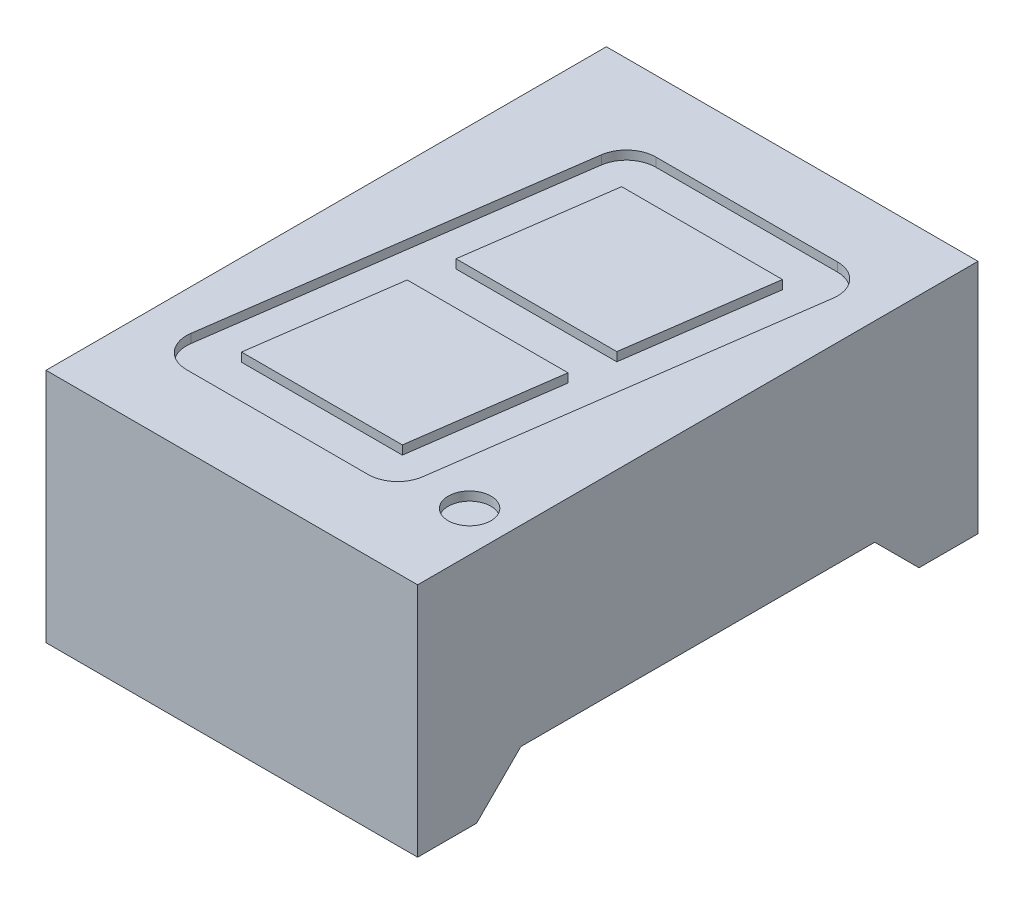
ISO-10303-21;
HEADER;
FILE_DESCRIPTION(('STEP AP214'),'2;1');
FILE_NAME('part.step','',(''),(''),'','','');
FILE_SCHEMA(('AUTOMOTIVE_DESIGN { 1 0 10303 214 1 1 1 1 }'));
ENDSEC;
DATA;
#1=APPLICATION_CONTEXT('core data for automotive mechanical design processes');
#2=APPLICATION_PROTOCOL_DEFINITION('international standard','automotive_design',2000,#1);
#3=PRODUCT_CONTEXT('',#1,'mechanical');
#4=PRODUCT('Part','Part','',(#3));
#5=PRODUCT_RELATED_PRODUCT_CATEGORY('part','',(#4));
#6=PRODUCT_DEFINITION_FORMATION('','',#4);
#7=PRODUCT_DEFINITION_CONTEXT('part definition',#1,'design');
#8=PRODUCT_DEFINITION('design','',#6,#7);
#9=PRODUCT_DEFINITION_SHAPE('','',#8);
#10=(LENGTH_UNIT() NAMED_UNIT(*) SI_UNIT(.MILLI.,.METRE.));
#11=(NAMED_UNIT(*) PLANE_ANGLE_UNIT() SI_UNIT($,.RADIAN.));
#12=(NAMED_UNIT(*) SI_UNIT($,.STERADIAN.) SOLID_ANGLE_UNIT());
#13=UNCERTAINTY_MEASURE_WITH_UNIT(LENGTH_MEASURE(1.E-05),#10,'distance_accuracy_value','');
#14=(GEOMETRIC_REPRESENTATION_CONTEXT(3) GLOBAL_UNCERTAINTY_ASSIGNED_CONTEXT((#13)) GLOBAL_UNIT_ASSIGNED_CONTEXT((#10,
#11,#12)) REPRESENTATION_CONTEXT('',''));
#15=CARTESIAN_POINT('',(0.,0.,0.));
#16=DIRECTION('',(0.,0.,1.));
#17=DIRECTION('',(1.,0.,0.));
#18=AXIS2_PLACEMENT_3D('',#15,#16,#17);
#19=CARTESIAN_POINT('',(0.,0.,0.));
#20=DIRECTION('',(0.,1.,0.));
#21=DIRECTION('',(0.,0.,1.));
#22=AXIS2_PLACEMENT_3D('',#19,#20,#21);
#23=PLANE('',#22);
#24=DIRECTION('',(0.,0.,-1.));
#25=VECTOR('',#24,1.);
#26=CARTESIAN_POINT('',(12.6,0.,0.));
#27=LINE('',#26,#25);
#28=CARTESIAN_POINT('',(12.6,0.,2.00000000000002));
#29=VERTEX_POINT('',#28);
#30=CARTESIAN_POINT('',(12.6,0.,0.));
#31=VERTEX_POINT('',#30);
#32=EDGE_CURVE('E382',#29,#31,#27,.T.);
#33=ORIENTED_EDGE('',*,*,#32,.F.);
#34=DIRECTION('',(-1.,0.,0.));
#35=VECTOR('',#34,1.);
#36=CARTESIAN_POINT('',(12.6,0.,2.00000000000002));
#37=LINE('',#36,#35);
#38=CARTESIAN_POINT('',(0.,0.,2.00000000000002));
#39=VERTEX_POINT('',#38);
#40=EDGE_CURVE('E226',#29,#39,#37,.T.);
#41=ORIENTED_EDGE('',*,*,#40,.T.);
#42=DIRECTION('',(0.,0.,1.));
#43=VECTOR('',#42,1.);
#44=CARTESIAN_POINT('',(0.,0.,0.));
#45=LINE('',#44,#43);
#46=CARTESIAN_POINT('',(0.,0.,0.));
#47=VERTEX_POINT('',#46);
#48=EDGE_CURVE('E377',#47,#39,#45,.T.);
#49=ORIENTED_EDGE('',*,*,#48,.F.);
#50=DIRECTION('',(-1.,0.,0.));
#51=VECTOR('',#50,1.);
#52=CARTESIAN_POINT('',(0.,0.,0.));
#53=LINE('',#52,#51);
#54=EDGE_CURVE('E370',#31,#47,#53,.T.);
#55=ORIENTED_EDGE('',*,*,#54,.F.);
#56=EDGE_LOOP('',(#33,#41,#49,#55));
#57=FACE_BOUND('',#56,.T.);
#58=ADVANCED_FACE('F35',(#57),#23,.F.);
#59=CARTESIAN_POINT('',(0.,8.,0.));
#60=DIRECTION('',(1.,0.,0.));
#61=DIRECTION('',(0.,0.,-1.));
#62=AXIS2_PLACEMENT_3D('',#59,#60,#61);
#63=PLANE('',#62);
#64=ORIENTED_EDGE('',*,*,#48,.T.);
#65=DIRECTION('',(0.,-0.707106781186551,-0.707106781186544));
#66=VECTOR('',#65,1.);
#67=CARTESIAN_POINT('',(0.,0.,2.00000000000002));
#68=LINE('',#67,#66);
#69=CARTESIAN_POINT('',(0.,1.5,3.5));
#70=VERTEX_POINT('',#69);
#71=EDGE_CURVE('E218',#70,#39,#68,.T.);
#72=ORIENTED_EDGE('',*,*,#71,.F.);
#73=DIRECTION('',(0.,0.,-1.));
#74=VECTOR('',#73,1.);
#75=CARTESIAN_POINT('',(0.,1.5,3.5));
#76=LINE('',#75,#74);
#77=CARTESIAN_POINT('',(0.,1.5,15.5));
#78=VERTEX_POINT('',#77);
#79=EDGE_CURVE('E220',#78,#70,#76,.T.);
#80=ORIENTED_EDGE('',*,*,#79,.F.);
#81=DIRECTION('',(0.,0.707106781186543,-0.707106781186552));
#82=VECTOR('',#81,1.);
#83=CARTESIAN_POINT('',(0.,1.5,15.5));
#84=LINE('',#83,#82);
#85=CARTESIAN_POINT('',(0.,0.,17.));
#86=VERTEX_POINT('',#85);
#87=EDGE_CURVE('E198',#86,#78,#84,.T.);
#88=ORIENTED_EDGE('',*,*,#87,.F.);
#89=CARTESIAN_POINT('',(0.,0.,19.));
#90=VERTEX_POINT('',#89);
#91=EDGE_CURVE('E352',#86,#90,#45,.T.);
#92=ORIENTED_EDGE('',*,*,#91,.T.);
#93=DIRECTION('',(0.,-1.,0.));
#94=VECTOR('',#93,1.);
#95=CARTESIAN_POINT('',(0.,8.,19.));
#96=LINE('',#95,#94);
#97=CARTESIAN_POINT('',(0.,8.,19.));
#98=VERTEX_POINT('',#97);
#99=EDGE_CURVE('E11',#98,#90,#96,.T.);
#100=ORIENTED_EDGE('',*,*,#99,.F.);
#101=DIRECTION('',(0.,0.,1.));
#102=VECTOR('',#101,1.);
#103=CARTESIAN_POINT('',(0.,8.,0.));
#104=LINE('',#103,#102);
#105=CARTESIAN_POINT('',(0.,8.,0.));
#106=VERTEX_POINT('',#105);
#107=EDGE_CURVE('E366',#106,#98,#104,.T.);
#108=ORIENTED_EDGE('',*,*,#107,.F.);
#109=DIRECTION('',(0.,-1.,0.));
#110=VECTOR('',#109,1.);
#111=CARTESIAN_POINT('',(0.,8.,0.));
#112=LINE('',#111,#110);
#113=EDGE_CURVE('E376',#106,#47,#112,.T.);
#114=ORIENTED_EDGE('',*,*,#113,.T.);
#115=EDGE_LOOP('',(#64,#72,#80,#88,#92,#100,#108,#114));
#116=FACE_BOUND('',#115,.T.);
#117=ADVANCED_FACE('F37',(#116),#63,.F.);
#118=CARTESIAN_POINT('',(0.,8.,19.));
#119=DIRECTION('',(0.,0.,-1.));
#120=DIRECTION('',(-1.,0.,0.));
#121=AXIS2_PLACEMENT_3D('',#118,#119,#120);
#122=PLANE('',#121);
#123=DIRECTION('',(1.,0.,0.));
#124=VECTOR('',#123,1.);
#125=CARTESIAN_POINT('',(0.,0.,19.));
#126=LINE('',#125,#124);
#127=CARTESIAN_POINT('',(12.6,0.,19.));
#128=VERTEX_POINT('',#127);
#129=EDGE_CURVE('E380',#90,#128,#126,.T.);
#130=ORIENTED_EDGE('',*,*,#129,.T.);
#131=DIRECTION('',(0.,-1.,0.));
#132=VECTOR('',#131,1.);
#133=CARTESIAN_POINT('',(12.6,8.,19.));
#134=LINE('',#133,#132);
#135=CARTESIAN_POINT('',(12.6,8.,19.));
#136=VERTEX_POINT('',#135);
#137=EDGE_CURVE('E43',#136,#128,#134,.T.);
#138=ORIENTED_EDGE('',*,*,#137,.F.);
#139=DIRECTION('',(1.,0.,0.));
#140=VECTOR('',#139,1.);
#141=CARTESIAN_POINT('',(0.,8.,19.));
#142=LINE('',#141,#140);
#143=EDGE_CURVE('E369',#98,#136,#142,.T.);
#144=ORIENTED_EDGE('',*,*,#143,.F.);
#145=ORIENTED_EDGE('',*,*,#99,.T.);
#146=EDGE_LOOP('',(#130,#138,#144,#145));
#147=FACE_BOUND('',#146,.T.);
#148=ADVANCED_FACE('F413',(#147),#122,.F.);
#149=CARTESIAN_POINT('',(12.6,8.,0.));
#150=DIRECTION('',(-1.,0.,0.));
#151=DIRECTION('',(0.,0.,1.));
#152=AXIS2_PLACEMENT_3D('',#149,#150,#151);
#153=PLANE('',#152);
#154=DIRECTION('',(0.,0.,-1.));
#155=VECTOR('',#154,1.);
#156=CARTESIAN_POINT('',(12.6,1.5,3.5));
#157=LINE('',#156,#155);
#158=CARTESIAN_POINT('',(12.6,1.5,15.5));
#159=VERTEX_POINT('',#158);
#160=CARTESIAN_POINT('',(12.6,1.5,3.5));
#161=VERTEX_POINT('',#160);
#162=EDGE_CURVE('E206',#159,#161,#157,.T.);
#163=ORIENTED_EDGE('',*,*,#162,.T.);
#164=DIRECTION('',(0.,-0.707106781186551,-0.707106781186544));
#165=VECTOR('',#164,1.);
#166=CARTESIAN_POINT('',(12.6,0.,2.00000000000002));
#167=LINE('',#166,#165);
#168=EDGE_CURVE('E211',#161,#29,#167,.T.);
#169=ORIENTED_EDGE('',*,*,#168,.T.);
#170=ORIENTED_EDGE('',*,*,#32,.T.);
#171=DIRECTION('',(0.,-1.,0.));
#172=VECTOR('',#171,1.);
#173=CARTESIAN_POINT('',(12.6,8.,0.));
#174=LINE('',#173,#172);
#175=CARTESIAN_POINT('',(12.6,8.,0.));
#176=VERTEX_POINT('',#175);
#177=EDGE_CURVE('E387',#176,#31,#174,.T.);
#178=ORIENTED_EDGE('',*,*,#177,.F.);
#179=DIRECTION('',(0.,0.,-1.));
#180=VECTOR('',#179,1.);
#181=CARTESIAN_POINT('',(12.6,8.,0.));
#182=LINE('',#181,#180);
#183=EDGE_CURVE('E372',#136,#176,#182,.T.);
#184=ORIENTED_EDGE('',*,*,#183,.F.);
#185=ORIENTED_EDGE('',*,*,#137,.T.);
#186=CARTESIAN_POINT('',(12.6,0.,17.));
#187=VERTEX_POINT('',#186);
#188=EDGE_CURVE('E217',#128,#187,#27,.T.);
#189=ORIENTED_EDGE('',*,*,#188,.T.);
#190=DIRECTION('',(0.,0.707106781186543,-0.707106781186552));
#191=VECTOR('',#190,1.);
#192=CARTESIAN_POINT('',(12.6,1.5,15.5));
#193=LINE('',#192,#191);
#194=EDGE_CURVE('E50',#187,#159,#193,.T.);
#195=ORIENTED_EDGE('',*,*,#194,.T.);
#196=EDGE_LOOP('',(#163,#169,#170,#178,#184,#185,#189,#195));
#197=FACE_BOUND('',#196,.T.);
#198=ADVANCED_FACE('F214',(#197),#153,.F.);
#199=CARTESIAN_POINT('',(0.,8.,0.));
#200=DIRECTION('',(0.,0.,1.));
#201=DIRECTION('',(1.,0.,0.));
#202=AXIS2_PLACEMENT_3D('',#199,#200,#201);
#203=PLANE('',#202);
#204=ORIENTED_EDGE('',*,*,#54,.T.);
#205=ORIENTED_EDGE('',*,*,#113,.F.);
#206=DIRECTION('',(-1.,0.,0.));
#207=VECTOR('',#206,1.);
#208=CARTESIAN_POINT('',(0.,8.,0.));
#209=LINE('',#208,#207);
#210=EDGE_CURVE('E374',#176,#106,#209,.T.);
#211=ORIENTED_EDGE('',*,*,#210,.F.);
#212=ORIENTED_EDGE('',*,*,#177,.T.);
#213=EDGE_LOOP('',(#204,#205,#211,#212));
#214=FACE_BOUND('',#213,.T.);
#215=ADVANCED_FACE('F408',(#214),#203,.F.);
#216=CARTESIAN_POINT('',(0.,8.,0.));
#217=DIRECTION('',(0.,1.,0.));
#218=DIRECTION('',(0.,0.,1.));
#219=AXIS2_PLACEMENT_3D('',#216,#217,#218);
#220=PLANE('',#219);
#221=CARTESIAN_POINT('',(11.2372731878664,8.,15.875));
#222=DIRECTION('',(0.,1.,0.));
#223=DIRECTION('',(0.,0.,1.));
#224=AXIS2_PLACEMENT_3D('',#221,#222,#223);
#225=CIRCLE('',#224,0.725);
#226=CARTESIAN_POINT('',(11.2372731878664,8.,16.6));
#227=VERTEX_POINT('',#226);
#228=EDGE_CURVE('E229',#227,#227,#225,.T.);
#229=ORIENTED_EDGE('',*,*,#228,.F.);
#230=EDGE_LOOP('',(#229));
#231=FACE_BOUND('',#230,.T.);
#232=CARTESIAN_POINT('',(8.52267500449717,8.,15.6));
#233=DIRECTION('',(0.,1.,0.));
#234=DIRECTION('',(0.,0.,-1.));
#235=AXIS2_PLACEMENT_3D('',#232,#233,#234);
#236=CIRCLE('',#235,1.);
#237=CARTESIAN_POINT('',(8.52267500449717,8.,16.6));
#238=VERTEX_POINT('',#237);
#239=CARTESIAN_POINT('',(9.51294307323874,8.,15.7391731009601));
#240=VERTEX_POINT('',#239);
#241=EDGE_CURVE('E58',#238,#240,#236,.T.);
#242=ORIENTED_EDGE('',*,*,#241,.F.);
#243=DIRECTION('',(1.,0.,0.));
#244=VECTOR('',#243,1.);
#245=CARTESIAN_POINT('',(8.52267500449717,8.,16.6));
#246=LINE('',#245,#244);
#247=CARTESIAN_POINT('',(2.3627268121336,8.,16.6));
#248=VERTEX_POINT('',#247);
#249=EDGE_CURVE('E307',#248,#238,#246,.T.);
#250=ORIENTED_EDGE('',*,*,#249,.F.);
#251=CARTESIAN_POINT('',(2.3627268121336,8.,15.6));
#252=DIRECTION('',(0.,1.,0.));
#253=DIRECTION('',(0.,0.,1.));
#254=AXIS2_PLACEMENT_3D('',#251,#252,#253);
#255=CIRCLE('',#254,1.);
#256=CARTESIAN_POINT('',(1.37245874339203,8.,15.4608268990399));
#257=VERTEX_POINT('',#256);
#258=EDGE_CURVE('E345',#257,#248,#255,.T.);
#259=ORIENTED_EDGE('',*,*,#258,.F.);
#260=DIRECTION('',(-0.139173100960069,0.,0.99026806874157));
#261=VECTOR('',#260,1.);
#262=CARTESIAN_POINT('',(1.37245874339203,8.,15.4608268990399));
#263=LINE('',#262,#261);
#264=CARTESIAN_POINT('',(3.08705692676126,8.,3.26082689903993));
#265=VERTEX_POINT('',#264);
#266=EDGE_CURVE('E342',#265,#257,#263,.T.);
#267=ORIENTED_EDGE('',*,*,#266,.F.);
#268=CARTESIAN_POINT('',(4.07732499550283,8.,3.4));
#269=DIRECTION('',(0.,1.,0.));
#270=DIRECTION('',(0.,0.,-1.));
#271=AXIS2_PLACEMENT_3D('',#268,#269,#270);
#272=CIRCLE('',#271,1.);
#273=CARTESIAN_POINT('',(4.07732499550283,8.,2.4));
#274=VERTEX_POINT('',#273);
#275=EDGE_CURVE('E339',#274,#265,#272,.T.);
#276=ORIENTED_EDGE('',*,*,#275,.F.);
#277=DIRECTION('',(-1.,0.,0.));
#278=VECTOR('',#277,1.);
#279=CARTESIAN_POINT('',(4.07732499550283,8.,2.4));
#280=LINE('',#279,#278);
#281=CARTESIAN_POINT('',(10.2372731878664,8.,2.4));
#282=VERTEX_POINT('',#281);
#283=EDGE_CURVE('E336',#282,#274,#280,.T.);
#284=ORIENTED_EDGE('',*,*,#283,.F.);
#285=CARTESIAN_POINT('',(10.2372731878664,8.,3.4));
#286=DIRECTION('',(0.,1.,0.));
#287=DIRECTION('',(0.,0.,-1.));
#288=AXIS2_PLACEMENT_3D('',#285,#286,#287);
#289=CIRCLE('',#288,1.);
#290=CARTESIAN_POINT('',(11.227541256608,8.,3.53917310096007));
#291=VERTEX_POINT('',#290);
#292=EDGE_CURVE('E333',#291,#282,#289,.T.);
#293=ORIENTED_EDGE('',*,*,#292,.F.);
#294=DIRECTION('',(0.139173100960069,0.,-0.99026806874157));
#295=VECTOR('',#294,1.);
#296=CARTESIAN_POINT('',(11.227541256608,8.,3.53917310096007));
#297=LINE('',#296,#295);
#298=EDGE_CURVE('E330',#240,#291,#297,.T.);
#299=ORIENTED_EDGE('',*,*,#298,.F.);
#300=EDGE_LOOP('',(#242,#250,#259,#267,#276,#284,#293,#299));
#301=FACE_BOUND('',#300,.T.);
#302=ORIENTED_EDGE('',*,*,#107,.T.);
#303=ORIENTED_EDGE('',*,*,#143,.T.);
#304=ORIENTED_EDGE('',*,*,#183,.T.);
#305=ORIENTED_EDGE('',*,*,#210,.T.);
#306=EDGE_LOOP('',(#302,#303,#304,#305));
#307=FACE_BOUND('',#306,.T.);
#308=ADVANCED_FACE('F412',(#231,#301,#307),#220,.T.);
#309=ORIENTED_EDGE('',*,*,#91,.F.);
#310=DIRECTION('',(-1.,0.,0.));
#311=VECTOR('',#310,1.);
#312=CARTESIAN_POINT('',(12.6,0.,17.));
#313=LINE('',#312,#311);
#314=EDGE_CURVE('E203',#187,#86,#313,.T.);
#315=ORIENTED_EDGE('',*,*,#314,.F.);
#316=ORIENTED_EDGE('',*,*,#188,.F.);
#317=ORIENTED_EDGE('',*,*,#129,.F.);
#318=EDGE_LOOP('',(#309,#315,#316,#317));
#319=FACE_BOUND('',#318,.T.);
#320=ADVANCED_FACE('F396',(#319),#23,.F.);
#321=CARTESIAN_POINT('',(8.52267500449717,7.7,15.6));
#322=DIRECTION('',(0.,1.,0.));
#323=DIRECTION('',(0.,0.,1.));
#324=AXIS2_PLACEMENT_3D('',#321,#322,#323);
#325=CYLINDRICAL_SURFACE('',#324,1.);
#326=ORIENTED_EDGE('',*,*,#241,.T.);
#327=DIRECTION('',(0.,1.,0.));
#328=VECTOR('',#327,1.);
#329=CARTESIAN_POINT('',(9.51294307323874,7.7,15.7391731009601));
#330=LINE('',#329,#328);
#331=CARTESIAN_POINT('',(9.51294307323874,7.7,15.7391731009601));
#332=VERTEX_POINT('',#331);
#333=EDGE_CURVE('E328',#332,#240,#330,.T.);
#334=ORIENTED_EDGE('',*,*,#333,.F.);
#335=CARTESIAN_POINT('',(8.52267500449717,7.7,15.6));
#336=DIRECTION('',(0.,1.,0.));
#337=DIRECTION('',(0.,0.,-1.));
#338=AXIS2_PLACEMENT_3D('',#335,#336,#337);
#339=CIRCLE('',#338,1.);
#340=CARTESIAN_POINT('',(8.52267500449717,7.7,16.6));
#341=VERTEX_POINT('',#340);
#342=EDGE_CURVE('E303',#341,#332,#339,.T.);
#343=ORIENTED_EDGE('',*,*,#342,.F.);
#344=DIRECTION('',(0.,1.,0.));
#345=VECTOR('',#344,1.);
#346=CARTESIAN_POINT('',(8.52267500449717,7.7,16.6));
#347=LINE('',#346,#345);
#348=EDGE_CURVE('E350',#341,#238,#347,.T.);
#349=ORIENTED_EDGE('',*,*,#348,.T.);
#350=EDGE_LOOP('',(#326,#334,#343,#349));
#351=FACE_BOUND('',#350,.T.);
#352=ADVANCED_FACE('F427',(#351),#325,.F.);
#353=CARTESIAN_POINT('',(8.52267500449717,7.7,16.6));
#354=DIRECTION('',(0.,0.,1.));
#355=DIRECTION('',(1.,0.,0.));
#356=AXIS2_PLACEMENT_3D('',#353,#354,#355);
#357=PLANE('',#356);
#358=ORIENTED_EDGE('',*,*,#249,.T.);
#359=ORIENTED_EDGE('',*,*,#348,.F.);
#360=DIRECTION('',(1.,0.,0.));
#361=VECTOR('',#360,1.);
#362=CARTESIAN_POINT('',(8.52267500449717,7.7,16.6));
#363=LINE('',#362,#361);
#364=CARTESIAN_POINT('',(2.3627268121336,7.7,16.6));
#365=VERTEX_POINT('',#364);
#366=EDGE_CURVE('E325',#365,#341,#363,.T.);
#367=ORIENTED_EDGE('',*,*,#366,.F.);
#368=DIRECTION('',(0.,1.,0.));
#369=VECTOR('',#368,1.);
#370=CARTESIAN_POINT('',(2.3627268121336,7.7,16.6));
#371=LINE('',#370,#369);
#372=EDGE_CURVE('E353',#365,#248,#371,.T.);
#373=ORIENTED_EDGE('',*,*,#372,.T.);
#374=EDGE_LOOP('',(#358,#359,#367,#373));
#375=FACE_BOUND('',#374,.T.);
#376=ADVANCED_FACE('F432',(#375),#357,.F.);
#377=CARTESIAN_POINT('',(2.3627268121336,7.7,15.6));
#378=DIRECTION('',(0.,1.,0.));
#379=DIRECTION('',(0.,0.,1.));
#380=AXIS2_PLACEMENT_3D('',#377,#378,#379);
#381=CYLINDRICAL_SURFACE('',#380,1.);
#382=ORIENTED_EDGE('',*,*,#258,.T.);
#383=ORIENTED_EDGE('',*,*,#372,.F.);
#384=CARTESIAN_POINT('',(2.3627268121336,7.7,15.6));
#385=DIRECTION('',(0.,1.,0.));
#386=DIRECTION('',(0.,0.,1.));
#387=AXIS2_PLACEMENT_3D('',#384,#385,#386);
#388=CIRCLE('',#387,1.);
#389=CARTESIAN_POINT('',(1.37245874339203,7.7,15.4608268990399));
#390=VERTEX_POINT('',#389);
#391=EDGE_CURVE('E322',#390,#365,#388,.T.);
#392=ORIENTED_EDGE('',*,*,#391,.F.);
#393=DIRECTION('',(0.,1.,0.));
#394=VECTOR('',#393,1.);
#395=CARTESIAN_POINT('',(1.37245874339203,7.7,15.4608268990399));
#396=LINE('',#395,#394);
#397=EDGE_CURVE('E355',#390,#257,#396,.T.);
#398=ORIENTED_EDGE('',*,*,#397,.T.);
#399=EDGE_LOOP('',(#382,#383,#392,#398));
#400=FACE_BOUND('',#399,.T.);
#401=ADVANCED_FACE('F505',(#400),#381,.F.);
#402=CARTESIAN_POINT('',(1.37245874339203,7.7,15.4608268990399));
#403=DIRECTION('',(-0.99026806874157,0.,-0.139173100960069));
#404=DIRECTION('',(-0.139173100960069,0.,0.99026806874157));
#405=AXIS2_PLACEMENT_3D('',#402,#403,#404);
#406=PLANE('',#405);
#407=ORIENTED_EDGE('',*,*,#266,.T.);
#408=ORIENTED_EDGE('',*,*,#397,.F.);
#409=DIRECTION('',(-0.139173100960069,0.,0.99026806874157));
#410=VECTOR('',#409,1.);
#411=CARTESIAN_POINT('',(1.37245874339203,7.7,15.4608268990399));
#412=LINE('',#411,#410);
#413=CARTESIAN_POINT('',(3.08705692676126,7.7,3.26082689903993));
#414=VERTEX_POINT('',#413);
#415=EDGE_CURVE('E319',#414,#390,#412,.T.);
#416=ORIENTED_EDGE('',*,*,#415,.F.);
#417=DIRECTION('',(0.,1.,0.));
#418=VECTOR('',#417,1.);
#419=CARTESIAN_POINT('',(3.08705692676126,7.7,3.26082689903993));
#420=LINE('',#419,#418);
#421=EDGE_CURVE('E357',#414,#265,#420,.T.);
#422=ORIENTED_EDGE('',*,*,#421,.T.);
#423=EDGE_LOOP('',(#407,#408,#416,#422));
#424=FACE_BOUND('',#423,.T.);
#425=ADVANCED_FACE('F499',(#424),#406,.F.);
#426=CARTESIAN_POINT('',(4.07732499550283,7.7,3.4));
#427=DIRECTION('',(0.,1.,0.));
#428=DIRECTION('',(0.,0.,1.));
#429=AXIS2_PLACEMENT_3D('',#426,#427,#428);
#430=CYLINDRICAL_SURFACE('',#429,1.);
#431=ORIENTED_EDGE('',*,*,#275,.T.);
#432=ORIENTED_EDGE('',*,*,#421,.F.);
#433=CARTESIAN_POINT('',(4.07732499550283,7.7,3.4));
#434=DIRECTION('',(0.,1.,0.));
#435=DIRECTION('',(0.,0.,-1.));
#436=AXIS2_PLACEMENT_3D('',#433,#434,#435);
#437=CIRCLE('',#436,1.);
#438=CARTESIAN_POINT('',(4.07732499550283,7.7,2.4));
#439=VERTEX_POINT('',#438);
#440=EDGE_CURVE('E316',#439,#414,#437,.T.);
#441=ORIENTED_EDGE('',*,*,#440,.F.);
#442=DIRECTION('',(0.,1.,0.));
#443=VECTOR('',#442,1.);
#444=CARTESIAN_POINT('',(4.07732499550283,7.7,2.4));
#445=LINE('',#444,#443);
#446=EDGE_CURVE('E359',#439,#274,#445,.T.);
#447=ORIENTED_EDGE('',*,*,#446,.T.);
#448=EDGE_LOOP('',(#431,#432,#441,#447));
#449=FACE_BOUND('',#448,.T.);
#450=ADVANCED_FACE('F495',(#449),#430,.F.);
#451=CARTESIAN_POINT('',(4.07732499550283,7.7,2.4));
#452=DIRECTION('',(0.,0.,-1.));
#453=DIRECTION('',(-1.,0.,0.));
#454=AXIS2_PLACEMENT_3D('',#451,#452,#453);
#455=PLANE('',#454);
#456=ORIENTED_EDGE('',*,*,#283,.T.);
#457=ORIENTED_EDGE('',*,*,#446,.F.);
#458=DIRECTION('',(-1.,0.,0.));
#459=VECTOR('',#458,1.);
#460=CARTESIAN_POINT('',(4.07732499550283,7.7,2.4));
#461=LINE('',#460,#459);
#462=CARTESIAN_POINT('',(10.2372731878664,7.7,2.4));
#463=VERTEX_POINT('',#462);
#464=EDGE_CURVE('E313',#463,#439,#461,.T.);
#465=ORIENTED_EDGE('',*,*,#464,.F.);
#466=DIRECTION('',(0.,1.,0.));
#467=VECTOR('',#466,1.);
#468=CARTESIAN_POINT('',(10.2372731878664,7.7,2.4));
#469=LINE('',#468,#467);
#470=EDGE_CURVE('E361',#463,#282,#469,.T.);
#471=ORIENTED_EDGE('',*,*,#470,.T.);
#472=EDGE_LOOP('',(#456,#457,#465,#471));
#473=FACE_BOUND('',#472,.T.);
#474=ADVANCED_FACE('F491',(#473),#455,.F.);
#475=CARTESIAN_POINT('',(10.2372731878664,7.7,3.4));
#476=DIRECTION('',(0.,1.,0.));
#477=DIRECTION('',(0.,0.,1.));
#478=AXIS2_PLACEMENT_3D('',#475,#476,#477);
#479=CYLINDRICAL_SURFACE('',#478,1.);
#480=ORIENTED_EDGE('',*,*,#292,.T.);
#481=ORIENTED_EDGE('',*,*,#470,.F.);
#482=CARTESIAN_POINT('',(10.2372731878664,7.7,3.4));
#483=DIRECTION('',(0.,1.,0.));
#484=DIRECTION('',(0.,0.,-1.));
#485=AXIS2_PLACEMENT_3D('',#482,#483,#484);
#486=CIRCLE('',#485,1.);
#487=CARTESIAN_POINT('',(11.227541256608,7.7,3.53917310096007));
#488=VERTEX_POINT('',#487);
#489=EDGE_CURVE('E310',#488,#463,#486,.T.);
#490=ORIENTED_EDGE('',*,*,#489,.F.);
#491=DIRECTION('',(0.,1.,0.));
#492=VECTOR('',#491,1.);
#493=CARTESIAN_POINT('',(11.227541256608,7.7,3.53917310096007));
#494=LINE('',#493,#492);
#495=EDGE_CURVE('E363',#488,#291,#494,.T.);
#496=ORIENTED_EDGE('',*,*,#495,.T.);
#497=EDGE_LOOP('',(#480,#481,#490,#496));
#498=FACE_BOUND('',#497,.T.);
#499=ADVANCED_FACE('F487',(#498),#479,.F.);
#500=CARTESIAN_POINT('',(11.227541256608,7.7,3.53917310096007));
#501=DIRECTION('',(0.99026806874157,0.,0.139173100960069));
#502=DIRECTION('',(0.139173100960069,0.,-0.99026806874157));
#503=AXIS2_PLACEMENT_3D('',#500,#501,#502);
#504=PLANE('',#503);
#505=ORIENTED_EDGE('',*,*,#298,.T.);
#506=ORIENTED_EDGE('',*,*,#495,.F.);
#507=DIRECTION('',(0.139173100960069,0.,-0.99026806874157));
#508=VECTOR('',#507,1.);
#509=CARTESIAN_POINT('',(11.227541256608,7.7,3.53917310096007));
#510=LINE('',#509,#508);
#511=EDGE_CURVE('E306',#332,#488,#510,.T.);
#512=ORIENTED_EDGE('',*,*,#511,.F.);
#513=ORIENTED_EDGE('',*,*,#333,.T.);
#514=EDGE_LOOP('',(#505,#506,#512,#513));
#515=FACE_BOUND('',#514,.T.);
#516=ADVANCED_FACE('F473',(#515),#504,.F.);
#517=CARTESIAN_POINT('',(8.52267500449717,7.7,15.6));
#518=DIRECTION('',(0.,-1.,0.));
#519=DIRECTION('',(0.,0.,-1.));
#520=AXIS2_PLACEMENT_3D('',#517,#518,#519);
#521=PLANE('',#520);
#522=DIRECTION('',(1.,0.,0.));
#523=VECTOR('',#522,1.);
#524=CARTESIAN_POINT('',(8.23247872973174,7.7,15.15));
#525=LINE('',#524,#523);
#526=CARTESIAN_POINT('',(2.7794098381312,7.7,15.15));
#527=VERTEX_POINT('',#526);
#528=CARTESIAN_POINT('',(8.23247872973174,7.7,15.15));
#529=VERTEX_POINT('',#528);
#530=EDGE_CURVE('E238',#527,#529,#525,.T.);
#531=ORIENTED_EDGE('',*,*,#530,.F.);
#532=DIRECTION('',(-0.13917310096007,0.,0.99026806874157));
#533=VECTOR('',#532,1.);
#534=CARTESIAN_POINT('',(2.7794098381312,7.7,15.15));
#535=LINE('',#534,#533);
#536=CARTESIAN_POINT('',(3.4715734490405,7.7,10.225));
#537=VERTEX_POINT('',#536);
#538=EDGE_CURVE('E248',#537,#527,#535,.T.);
#539=ORIENTED_EDGE('',*,*,#538,.F.);
#540=DIRECTION('',(-1.,0.,0.));
#541=VECTOR('',#540,1.);
#542=CARTESIAN_POINT('',(3.4715734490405,7.7,10.225));
#543=LINE('',#542,#541);
#544=CARTESIAN_POINT('',(8.92464234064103,7.7,10.225));
#545=VERTEX_POINT('',#544);
#546=EDGE_CURVE('E245',#545,#537,#543,.T.);
#547=ORIENTED_EDGE('',*,*,#546,.F.);
#548=DIRECTION('',(0.139173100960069,0.,-0.99026806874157));
#549=VECTOR('',#548,1.);
#550=CARTESIAN_POINT('',(8.92464234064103,7.7,10.225));
#551=LINE('',#550,#549);
#552=EDGE_CURVE('E241',#529,#545,#551,.T.);
#553=ORIENTED_EDGE('',*,*,#552,.F.);
#554=EDGE_LOOP('',(#531,#539,#547,#553));
#555=FACE_BOUND('',#554,.T.);
#556=DIRECTION('',(1.,0.,0.));
#557=VECTOR('',#556,1.);
#558=CARTESIAN_POINT('',(9.12842655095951,7.7,8.775));
#559=LINE('',#558,#557);
#560=CARTESIAN_POINT('',(3.67535765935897,7.7,8.775));
#561=VERTEX_POINT('',#560);
#562=CARTESIAN_POINT('',(9.12842655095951,7.7,8.775));
#563=VERTEX_POINT('',#562);
#564=EDGE_CURVE('E271',#561,#563,#559,.T.);
#565=ORIENTED_EDGE('',*,*,#564,.F.);
#566=DIRECTION('',(-0.139173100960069,0.,0.99026806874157));
#567=VECTOR('',#566,1.);
#568=CARTESIAN_POINT('',(3.67535765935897,7.7,8.775));
#569=LINE('',#568,#567);
#570=CARTESIAN_POINT('',(4.36752127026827,7.7,3.85));
#571=VERTEX_POINT('',#570);
#572=EDGE_CURVE('E281',#571,#561,#569,.T.);
#573=ORIENTED_EDGE('',*,*,#572,.F.);
#574=DIRECTION('',(-1.,0.,0.));
#575=VECTOR('',#574,1.);
#576=CARTESIAN_POINT('',(4.36752127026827,7.7,3.85));
#577=LINE('',#576,#575);
#578=CARTESIAN_POINT('',(9.8205901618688,7.7,3.85));
#579=VERTEX_POINT('',#578);
#580=EDGE_CURVE('E278',#579,#571,#577,.T.);
#581=ORIENTED_EDGE('',*,*,#580,.F.);
#582=DIRECTION('',(0.139173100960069,0.,-0.99026806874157));
#583=VECTOR('',#582,1.);
#584=CARTESIAN_POINT('',(9.8205901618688,7.7,3.85));
#585=LINE('',#584,#583);
#586=EDGE_CURVE('E274',#563,#579,#585,.T.);
#587=ORIENTED_EDGE('',*,*,#586,.F.);
#588=EDGE_LOOP('',(#565,#573,#581,#587));
#589=FACE_BOUND('',#588,.T.);
#590=ORIENTED_EDGE('',*,*,#342,.T.);
#591=ORIENTED_EDGE('',*,*,#511,.T.);
#592=ORIENTED_EDGE('',*,*,#489,.T.);
#593=ORIENTED_EDGE('',*,*,#464,.T.);
#594=ORIENTED_EDGE('',*,*,#440,.T.);
#595=ORIENTED_EDGE('',*,*,#415,.T.);
#596=ORIENTED_EDGE('',*,*,#391,.T.);
#597=ORIENTED_EDGE('',*,*,#366,.T.);
#598=EDGE_LOOP('',(#590,#591,#592,#593,#594,#595,#596,#597));
#599=FACE_BOUND('',#598,.T.);
#600=ADVANCED_FACE('F469',(#555,#589,#599),#521,.F.);
#601=CARTESIAN_POINT('',(9.12842655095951,7.7,8.775));
#602=DIRECTION('',(0.,0.,1.));
#603=DIRECTION('',(1.,0.,0.));
#604=AXIS2_PLACEMENT_3D('',#601,#602,#603);
#605=PLANE('',#604);
#606=DIRECTION('',(1.,0.,0.));
#607=VECTOR('',#606,1.);
#608=CARTESIAN_POINT('',(9.12842655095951,8.,8.775));
#609=LINE('',#608,#607);
#610=CARTESIAN_POINT('',(3.67535765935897,8.,8.775));
#611=VERTEX_POINT('',#610);
#612=CARTESIAN_POINT('',(9.12842655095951,8.,8.775));
#613=VERTEX_POINT('',#612);
#614=EDGE_CURVE('E264',#611,#613,#609,.T.);
#615=ORIENTED_EDGE('',*,*,#614,.F.);
#616=DIRECTION('',(0.,1.,0.));
#617=VECTOR('',#616,1.);
#618=CARTESIAN_POINT('',(3.67535765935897,7.7,8.775));
#619=LINE('',#618,#617);
#620=EDGE_CURVE('E295',#561,#611,#619,.T.);
#621=ORIENTED_EDGE('',*,*,#620,.F.);
#622=ORIENTED_EDGE('',*,*,#564,.T.);
#623=DIRECTION('',(0.,1.,0.));
#624=VECTOR('',#623,1.);
#625=CARTESIAN_POINT('',(9.12842655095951,7.7,8.775));
#626=LINE('',#625,#624);
#627=EDGE_CURVE('E284',#563,#613,#626,.T.);
#628=ORIENTED_EDGE('',*,*,#627,.T.);
#629=EDGE_LOOP('',(#615,#621,#622,#628));
#630=FACE_BOUND('',#629,.T.);
#631=ADVANCED_FACE('F472',(#630),#605,.T.);
#632=CARTESIAN_POINT('',(3.67535765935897,7.7,8.775));
#633=DIRECTION('',(-0.99026806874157,0.,-0.139173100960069));
#634=DIRECTION('',(-0.139173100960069,0.,0.99026806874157));
#635=AXIS2_PLACEMENT_3D('',#632,#633,#634);
#636=PLANE('',#635);
#637=DIRECTION('',(-0.139173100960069,0.,0.99026806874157));
#638=VECTOR('',#637,1.);
#639=CARTESIAN_POINT('',(3.67535765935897,8.,8.775));
#640=LINE('',#639,#638);
#641=CARTESIAN_POINT('',(4.36752127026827,8.,3.85));
#642=VERTEX_POINT('',#641);
#643=EDGE_CURVE('E275',#642,#611,#640,.T.);
#644=ORIENTED_EDGE('',*,*,#643,.F.);
#645=DIRECTION('',(0.,1.,0.));
#646=VECTOR('',#645,1.);
#647=CARTESIAN_POINT('',(4.36752127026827,7.7,3.85));
#648=LINE('',#647,#646);
#649=EDGE_CURVE('E297',#571,#642,#648,.T.);
#650=ORIENTED_EDGE('',*,*,#649,.F.);
#651=ORIENTED_EDGE('',*,*,#572,.T.);
#652=ORIENTED_EDGE('',*,*,#620,.T.);
#653=EDGE_LOOP('',(#644,#650,#651,#652));
#654=FACE_BOUND('',#653,.T.);
#655=ADVANCED_FACE('F536',(#654),#636,.T.);
#656=CARTESIAN_POINT('',(4.36752127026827,7.7,3.85));
#657=DIRECTION('',(0.,0.,-1.));
#658=DIRECTION('',(-1.,0.,0.));
#659=AXIS2_PLACEMENT_3D('',#656,#657,#658);
#660=PLANE('',#659);
#661=DIRECTION('',(-1.,0.,0.));
#662=VECTOR('',#661,1.);
#663=CARTESIAN_POINT('',(4.36752127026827,8.,3.85));
#664=LINE('',#663,#662);
#665=CARTESIAN_POINT('',(9.8205901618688,8.,3.85));
#666=VERTEX_POINT('',#665);
#667=EDGE_CURVE('E290',#666,#642,#664,.T.);
#668=ORIENTED_EDGE('',*,*,#667,.F.);
#669=DIRECTION('',(0.,1.,0.));
#670=VECTOR('',#669,1.);
#671=CARTESIAN_POINT('',(9.8205901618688,7.7,3.85));
#672=LINE('',#671,#670);
#673=EDGE_CURVE('E299',#579,#666,#672,.T.);
#674=ORIENTED_EDGE('',*,*,#673,.F.);
#675=ORIENTED_EDGE('',*,*,#580,.T.);
#676=ORIENTED_EDGE('',*,*,#649,.T.);
#677=EDGE_LOOP('',(#668,#674,#675,#676));
#678=FACE_BOUND('',#677,.T.);
#679=ADVANCED_FACE('F544',(#678),#660,.T.);
#680=CARTESIAN_POINT('',(9.8205901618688,7.7,3.85));
#681=DIRECTION('',(0.99026806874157,0.,0.139173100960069));
#682=DIRECTION('',(0.139173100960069,0.,-0.99026806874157));
#683=AXIS2_PLACEMENT_3D('',#680,#681,#682);
#684=PLANE('',#683);
#685=DIRECTION('',(0.139173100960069,0.,-0.99026806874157));
#686=VECTOR('',#685,1.);
#687=CARTESIAN_POINT('',(9.8205901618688,8.,3.85));
#688=LINE('',#687,#686);
#689=EDGE_CURVE('E287',#613,#666,#688,.T.);
#690=ORIENTED_EDGE('',*,*,#689,.F.);
#691=ORIENTED_EDGE('',*,*,#627,.F.);
#692=ORIENTED_EDGE('',*,*,#586,.T.);
#693=ORIENTED_EDGE('',*,*,#673,.T.);
#694=EDGE_LOOP('',(#690,#691,#692,#693));
#695=FACE_BOUND('',#694,.T.);
#696=ADVANCED_FACE('F552',(#695),#684,.T.);
#697=CARTESIAN_POINT('',(8.23247872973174,7.7,15.15));
#698=DIRECTION('',(0.,0.,1.));
#699=DIRECTION('',(1.,0.,0.));
#700=AXIS2_PLACEMENT_3D('',#697,#698,#699);
#701=PLANE('',#700);
#702=DIRECTION('',(1.,0.,0.));
#703=VECTOR('',#702,1.);
#704=CARTESIAN_POINT('',(8.23247872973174,8.,15.15));
#705=LINE('',#704,#703);
#706=CARTESIAN_POINT('',(2.7794098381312,8.,15.15));
#707=VERTEX_POINT('',#706);
#708=CARTESIAN_POINT('',(8.23247872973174,8.,15.15));
#709=VERTEX_POINT('',#708);
#710=EDGE_CURVE('E235',#707,#709,#705,.T.);
#711=ORIENTED_EDGE('',*,*,#710,.F.);
#712=DIRECTION('',(0.,1.,0.));
#713=VECTOR('',#712,1.);
#714=CARTESIAN_POINT('',(2.7794098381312,7.7,15.15));
#715=LINE('',#714,#713);
#716=EDGE_CURVE('E262',#527,#707,#715,.T.);
#717=ORIENTED_EDGE('',*,*,#716,.F.);
#718=ORIENTED_EDGE('',*,*,#530,.T.);
#719=DIRECTION('',(0.,1.,0.));
#720=VECTOR('',#719,1.);
#721=CARTESIAN_POINT('',(8.23247872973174,7.7,15.15));
#722=LINE('',#721,#720);
#723=EDGE_CURVE('E251',#529,#709,#722,.T.);
#724=ORIENTED_EDGE('',*,*,#723,.T.);
#725=EDGE_LOOP('',(#711,#717,#718,#724));
#726=FACE_BOUND('',#725,.T.);
#727=ADVANCED_FACE('F461',(#726),#701,.T.);
#728=CARTESIAN_POINT('',(2.7794098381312,7.7,15.15));
#729=DIRECTION('',(-0.99026806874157,0.,-0.13917310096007));
#730=DIRECTION('',(-0.13917310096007,0.,0.99026806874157));
#731=AXIS2_PLACEMENT_3D('',#728,#729,#730);
#732=PLANE('',#731);
#733=DIRECTION('',(-0.13917310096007,0.,0.99026806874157));
#734=VECTOR('',#733,1.);
#735=CARTESIAN_POINT('',(2.7794098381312,8.,15.15));
#736=LINE('',#735,#734);
#737=CARTESIAN_POINT('',(3.4715734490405,8.,10.225));
#738=VERTEX_POINT('',#737);
#739=EDGE_CURVE('E242',#738,#707,#736,.T.);
#740=ORIENTED_EDGE('',*,*,#739,.F.);
#741=DIRECTION('',(0.,1.,0.));
#742=VECTOR('',#741,1.);
#743=CARTESIAN_POINT('',(3.4715734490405,7.7,10.225));
#744=LINE('',#743,#742);
#745=EDGE_CURVE('E265',#537,#738,#744,.T.);
#746=ORIENTED_EDGE('',*,*,#745,.F.);
#747=ORIENTED_EDGE('',*,*,#538,.T.);
#748=ORIENTED_EDGE('',*,*,#716,.T.);
#749=EDGE_LOOP('',(#740,#746,#747,#748));
#750=FACE_BOUND('',#749,.T.);
#751=ADVANCED_FACE('F457',(#750),#732,.T.);
#752=CARTESIAN_POINT('',(3.4715734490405,7.7,10.225));
#753=DIRECTION('',(0.,0.,-1.));
#754=DIRECTION('',(-1.,0.,0.));
#755=AXIS2_PLACEMENT_3D('',#752,#753,#754);
#756=PLANE('',#755);
#757=DIRECTION('',(-1.,0.,0.));
#758=VECTOR('',#757,1.);
#759=CARTESIAN_POINT('',(3.4715734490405,8.,10.225));
#760=LINE('',#759,#758);
#761=CARTESIAN_POINT('',(8.92464234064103,8.,10.225));
#762=VERTEX_POINT('',#761);
#763=EDGE_CURVE('E257',#762,#738,#760,.T.);
#764=ORIENTED_EDGE('',*,*,#763,.F.);
#765=DIRECTION('',(0.,1.,0.));
#766=VECTOR('',#765,1.);
#767=CARTESIAN_POINT('',(8.92464234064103,7.7,10.225));
#768=LINE('',#767,#766);
#769=EDGE_CURVE('E267',#545,#762,#768,.T.);
#770=ORIENTED_EDGE('',*,*,#769,.F.);
#771=ORIENTED_EDGE('',*,*,#546,.T.);
#772=ORIENTED_EDGE('',*,*,#745,.T.);
#773=EDGE_LOOP('',(#764,#770,#771,#772));
#774=FACE_BOUND('',#773,.T.);
#775=ADVANCED_FACE('F467',(#774),#756,.T.);
#776=CARTESIAN_POINT('',(8.92464234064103,7.7,10.225));
#777=DIRECTION('',(0.99026806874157,0.,0.139173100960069));
#778=DIRECTION('',(0.139173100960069,0.,-0.99026806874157));
#779=AXIS2_PLACEMENT_3D('',#776,#777,#778);
#780=PLANE('',#779);
#781=DIRECTION('',(0.139173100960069,0.,-0.99026806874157));
#782=VECTOR('',#781,1.);
#783=CARTESIAN_POINT('',(8.92464234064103,8.,10.225));
#784=LINE('',#783,#782);
#785=EDGE_CURVE('E254',#709,#762,#784,.T.);
#786=ORIENTED_EDGE('',*,*,#785,.F.);
#787=ORIENTED_EDGE('',*,*,#723,.F.);
#788=ORIENTED_EDGE('',*,*,#552,.T.);
#789=ORIENTED_EDGE('',*,*,#769,.T.);
#790=EDGE_LOOP('',(#786,#787,#788,#789));
#791=FACE_BOUND('',#790,.T.);
#792=ADVANCED_FACE('F443',(#791),#780,.T.);
#793=ORIENTED_EDGE('',*,*,#643,.T.);
#794=ORIENTED_EDGE('',*,*,#614,.T.);
#795=ORIENTED_EDGE('',*,*,#689,.T.);
#796=ORIENTED_EDGE('',*,*,#667,.T.);
#797=EDGE_LOOP('',(#793,#794,#795,#796));
#798=FACE_BOUND('',#797,.T.);
#799=ADVANCED_FACE('F435',(#798),#220,.T.);
#800=ORIENTED_EDGE('',*,*,#739,.T.);
#801=ORIENTED_EDGE('',*,*,#710,.T.);
#802=ORIENTED_EDGE('',*,*,#785,.T.);
#803=ORIENTED_EDGE('',*,*,#763,.T.);
#804=EDGE_LOOP('',(#800,#801,#802,#803));
#805=FACE_BOUND('',#804,.T.);
#806=ADVANCED_FACE('F436',(#805),#220,.T.);
#807=CARTESIAN_POINT('',(11.2372731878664,7.7,15.875));
#808=DIRECTION('',(0.,1.,0.));
#809=DIRECTION('',(0.,0.,1.));
#810=AXIS2_PLACEMENT_3D('',#807,#808,#809);
#811=CYLINDRICAL_SURFACE('',#810,0.725);
#812=CARTESIAN_POINT('',(11.2372731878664,7.7,15.875));
#813=DIRECTION('',(0.,1.,0.));
#814=DIRECTION('',(0.,0.,1.));
#815=AXIS2_PLACEMENT_3D('',#812,#813,#814);
#816=CIRCLE('',#815,0.725);
#817=CARTESIAN_POINT('',(11.2372731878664,7.7,16.6));
#818=VERTEX_POINT('',#817);
#819=EDGE_CURVE('E232',#818,#818,#816,.T.);
#820=ORIENTED_EDGE('',*,*,#819,.F.);
#821=EDGE_LOOP('',(#820));
#822=FACE_BOUND('',#821,.T.);
#823=ORIENTED_EDGE('',*,*,#228,.T.);
#824=EDGE_LOOP('',(#823));
#825=FACE_BOUND('',#824,.T.);
#826=ADVANCED_FACE('F446',(#822,#825),#811,.F.);
#827=CARTESIAN_POINT('',(11.2372731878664,7.7,15.875));
#828=DIRECTION('',(0.,1.,0.));
#829=DIRECTION('',(0.,0.,1.));
#830=AXIS2_PLACEMENT_3D('',#827,#828,#829);
#831=PLANE('',#830);
#832=ORIENTED_EDGE('',*,*,#819,.T.);
#833=EDGE_LOOP('',(#832));
#834=FACE_BOUND('',#833,.T.);
#835=ADVANCED_FACE('F451',(#834),#831,.T.);
#836=CARTESIAN_POINT('',(12.6,0.,2.00000000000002));
#837=DIRECTION('',(0.,0.707106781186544,-0.707106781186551));
#838=DIRECTION('',(0.,0.707106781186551,0.707106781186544));
#839=AXIS2_PLACEMENT_3D('',#836,#837,#838);
#840=PLANE('',#839);
#841=ORIENTED_EDGE('',*,*,#71,.T.);
#842=ORIENTED_EDGE('',*,*,#40,.F.);
#843=ORIENTED_EDGE('',*,*,#168,.F.);
#844=DIRECTION('',(-1.,0.,0.));
#845=VECTOR('',#844,1.);
#846=CARTESIAN_POINT('',(12.6,1.5,3.5));
#847=LINE('',#846,#845);
#848=EDGE_CURVE('E202',#161,#70,#847,.T.);
#849=ORIENTED_EDGE('',*,*,#848,.T.);
#850=EDGE_LOOP('',(#841,#842,#843,#849));
#851=FACE_BOUND('',#850,.T.);
#852=ADVANCED_FACE('F402',(#851),#840,.F.);
#853=CARTESIAN_POINT('',(12.6,1.5,3.5));
#854=DIRECTION('',(0.,1.,0.));
#855=DIRECTION('',(0.,0.,1.));
#856=AXIS2_PLACEMENT_3D('',#853,#854,#855);
#857=PLANE('',#856);
#858=ORIENTED_EDGE('',*,*,#79,.T.);
#859=ORIENTED_EDGE('',*,*,#848,.F.);
#860=ORIENTED_EDGE('',*,*,#162,.F.);
#861=DIRECTION('',(-1.,0.,0.));
#862=VECTOR('',#861,1.);
#863=CARTESIAN_POINT('',(12.6,1.5,15.5));
#864=LINE('',#863,#862);
#865=EDGE_CURVE('E194',#159,#78,#864,.T.);
#866=ORIENTED_EDGE('',*,*,#865,.T.);
#867=EDGE_LOOP('',(#858,#859,#860,#866));
#868=FACE_BOUND('',#867,.T.);
#869=ADVANCED_FACE('F207',(#868),#857,.F.);
#870=CARTESIAN_POINT('',(12.6,1.5,15.5));
#871=DIRECTION('',(0.,0.707106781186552,0.707106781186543));
#872=DIRECTION('',(0.,-0.707106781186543,0.707106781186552));
#873=AXIS2_PLACEMENT_3D('',#870,#871,#872);
#874=PLANE('',#873);
#875=ORIENTED_EDGE('',*,*,#87,.T.);
#876=ORIENTED_EDGE('',*,*,#865,.F.);
#877=ORIENTED_EDGE('',*,*,#194,.F.);
#878=ORIENTED_EDGE('',*,*,#314,.T.);
#879=EDGE_LOOP('',(#875,#876,#877,#878));
#880=FACE_BOUND('',#879,.T.);
#881=ADVANCED_FACE('F196',(#880),#874,.F.);
#882=CLOSED_SHELL('',(#58,#117,#148,#198,#215,#308,#320,#352,#376,#401,#425,#450,#474,#499,#516,
#600,#631,#655,#679,#696,#727,#751,#775,#792,#799,#806,#826,#835,#852,#869,#881));
#883=MANIFOLD_SOLID_BREP('B2',#882);
#884=ADVANCED_BREP_SHAPE_REPRESENTATION('',(#18,#883),#14);
#885=SHAPE_DEFINITION_REPRESENTATION(#9,#884);
ENDSEC;
END-ISO-10303-21;
